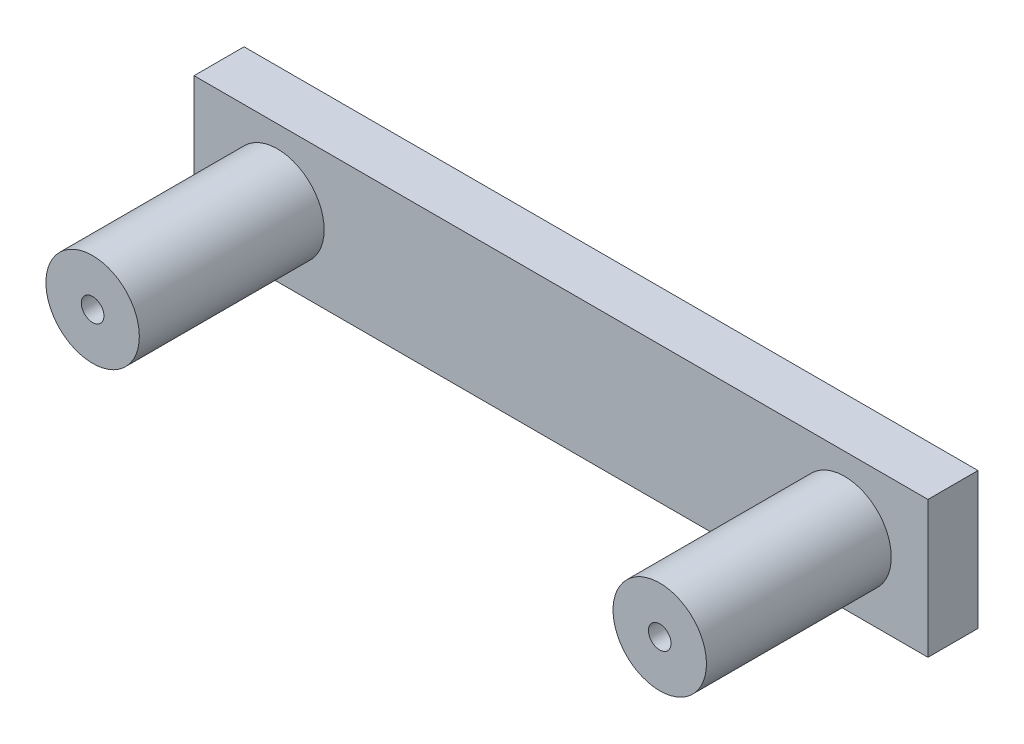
ISO-10303-21;
HEADER;
FILE_DESCRIPTION(('STEP AP214'),'2;1');
FILE_NAME('part.step','',(''),(''),'','','');
FILE_SCHEMA(('AUTOMOTIVE_DESIGN { 1 0 10303 214 1 1 1 1 }'));
ENDSEC;
DATA;
#1=APPLICATION_CONTEXT('core data for automotive mechanical design processes');
#2=APPLICATION_PROTOCOL_DEFINITION('international standard','automotive_design',2000,#1);
#3=PRODUCT_CONTEXT('',#1,'mechanical');
#4=PRODUCT('Part','Part','',(#3));
#5=PRODUCT_RELATED_PRODUCT_CATEGORY('part','',(#4));
#6=PRODUCT_DEFINITION_FORMATION('','',#4);
#7=PRODUCT_DEFINITION_CONTEXT('part definition',#1,'design');
#8=PRODUCT_DEFINITION('design','',#6,#7);
#9=PRODUCT_DEFINITION_SHAPE('','',#8);
#10=(LENGTH_UNIT() NAMED_UNIT(*) SI_UNIT(.MILLI.,.METRE.));
#11=(NAMED_UNIT(*) PLANE_ANGLE_UNIT() SI_UNIT($,.RADIAN.));
#12=(NAMED_UNIT(*) SI_UNIT($,.STERADIAN.) SOLID_ANGLE_UNIT());
#13=UNCERTAINTY_MEASURE_WITH_UNIT(LENGTH_MEASURE(1.E-05),#10,'distance_accuracy_value','');
#14=(GEOMETRIC_REPRESENTATION_CONTEXT(3) GLOBAL_UNCERTAINTY_ASSIGNED_CONTEXT((#13)) GLOBAL_UNIT_ASSIGNED_CONTEXT((#10,
#11,#12)) REPRESENTATION_CONTEXT('',''));
#15=CARTESIAN_POINT('',(0.,0.,0.));
#16=DIRECTION('',(0.,0.,1.));
#17=DIRECTION('',(1.,0.,0.));
#18=AXIS2_PLACEMENT_3D('',#15,#16,#17);
#19=CARTESIAN_POINT('',(-69.85,-13.0175,9.525));
#20=DIRECTION('',(0.,0.,1.));
#21=DIRECTION('',(1.,0.,0.));
#22=AXIS2_PLACEMENT_3D('',#19,#20,#21);
#23=PLANE('',#22);
#24=CARTESIAN_POINT('',(-53.975,0.,9.525));
#25=DIRECTION('',(0.,0.,1.));
#26=DIRECTION('',(1.,0.,0.));
#27=AXIS2_PLACEMENT_3D('',#24,#25,#26);
#28=CIRCLE('',#27,8.88999999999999);
#29=CARTESIAN_POINT('',(-45.085,0.,9.525));
#30=VERTEX_POINT('',#29);
#31=EDGE_CURVE('E110',#30,#30,#28,.T.);
#32=ORIENTED_EDGE('',*,*,#31,.F.);
#33=EDGE_LOOP('',(#32));
#34=FACE_BOUND('',#33,.T.);
#35=DIRECTION('',(0.,-1.,0.));
#36=VECTOR('',#35,1.);
#37=CARTESIAN_POINT('',(-69.85,13.0175,9.525));
#38=LINE('',#37,#36);
#39=CARTESIAN_POINT('',(-69.85,13.0175,9.525));
#40=VERTEX_POINT('',#39);
#41=CARTESIAN_POINT('',(-69.85,-13.0175,9.525));
#42=VERTEX_POINT('',#41);
#43=EDGE_CURVE('E84',#40,#42,#38,.T.);
#44=ORIENTED_EDGE('',*,*,#43,.T.);
#45=DIRECTION('',(1.,0.,0.));
#46=VECTOR('',#45,1.);
#47=CARTESIAN_POINT('',(-69.85,-13.0175,9.525));
#48=LINE('',#47,#46);
#49=CARTESIAN_POINT('',(69.85,-13.0175,9.525));
#50=VERTEX_POINT('',#49);
#51=EDGE_CURVE('E79',#42,#50,#48,.T.);
#52=ORIENTED_EDGE('',*,*,#51,.T.);
#53=DIRECTION('',(0.,1.,0.));
#54=VECTOR('',#53,1.);
#55=CARTESIAN_POINT('',(69.85,13.0175,9.525));
#56=LINE('',#55,#54);
#57=CARTESIAN_POINT('',(69.85,13.0175,9.525));
#58=VERTEX_POINT('',#57);
#59=EDGE_CURVE('E82',#50,#58,#56,.T.);
#60=ORIENTED_EDGE('',*,*,#59,.T.);
#61=DIRECTION('',(-1.,0.,0.));
#62=VECTOR('',#61,1.);
#63=CARTESIAN_POINT('',(-69.85,13.0175,9.525));
#64=LINE('',#63,#62);
#65=EDGE_CURVE('E49',#58,#40,#64,.T.);
#66=ORIENTED_EDGE('',*,*,#65,.T.);
#67=EDGE_LOOP('',(#44,#52,#60,#66));
#68=FACE_BOUND('',#67,.T.);
#69=CARTESIAN_POINT('',(53.975,0.,9.525));
#70=DIRECTION('',(0.,0.,1.));
#71=DIRECTION('',(1.,0.,0.));
#72=AXIS2_PLACEMENT_3D('',#69,#70,#71);
#73=CIRCLE('',#72,8.88999999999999);
#74=CARTESIAN_POINT('',(62.865,0.,9.525));
#75=VERTEX_POINT('',#74);
#76=EDGE_CURVE('E116',#75,#75,#73,.T.);
#77=ORIENTED_EDGE('',*,*,#76,.F.);
#78=EDGE_LOOP('',(#77));
#79=FACE_BOUND('',#78,.T.);
#80=ADVANCED_FACE('F32',(#34,#68,#79),#23,.T.);
#81=CARTESIAN_POINT('',(-69.85,13.0175,9.525));
#82=DIRECTION('',(1.,0.,0.));
#83=DIRECTION('',(0.,1.,0.));
#84=AXIS2_PLACEMENT_3D('',#81,#82,#83);
#85=PLANE('',#84);
#86=DIRECTION('',(0.,-1.,0.));
#87=VECTOR('',#86,1.);
#88=CARTESIAN_POINT('',(-69.85,13.0175,0.));
#89=LINE('',#88,#87);
#90=CARTESIAN_POINT('',(-69.85,13.0175,0.));
#91=VERTEX_POINT('',#90);
#92=CARTESIAN_POINT('',(-69.85,-13.0175,0.));
#93=VERTEX_POINT('',#92);
#94=EDGE_CURVE('E96',#91,#93,#89,.T.);
#95=ORIENTED_EDGE('',*,*,#94,.T.);
#96=DIRECTION('',(0.,0.,-1.));
#97=VECTOR('',#96,1.);
#98=CARTESIAN_POINT('',(-69.85,-13.0175,9.525));
#99=LINE('',#98,#97);
#100=EDGE_CURVE('E11',#42,#93,#99,.T.);
#101=ORIENTED_EDGE('',*,*,#100,.F.);
#102=ORIENTED_EDGE('',*,*,#43,.F.);
#103=DIRECTION('',(0.,0.,-1.));
#104=VECTOR('',#103,1.);
#105=CARTESIAN_POINT('',(-69.85,13.0175,9.525));
#106=LINE('',#105,#104);
#107=EDGE_CURVE('E92',#40,#91,#106,.T.);
#108=ORIENTED_EDGE('',*,*,#107,.T.);
#109=EDGE_LOOP('',(#95,#101,#102,#108));
#110=FACE_BOUND('',#109,.T.);
#111=ADVANCED_FACE('F34',(#110),#85,.F.);
#112=CARTESIAN_POINT('',(-69.85,-13.0175,9.525));
#113=DIRECTION('',(0.,1.,0.));
#114=DIRECTION('',(0.,0.,1.));
#115=AXIS2_PLACEMENT_3D('',#112,#113,#114);
#116=PLANE('',#115);
#117=DIRECTION('',(1.,0.,0.));
#118=VECTOR('',#117,1.);
#119=CARTESIAN_POINT('',(-69.85,-13.0175,0.));
#120=LINE('',#119,#118);
#121=CARTESIAN_POINT('',(69.85,-13.0175,0.));
#122=VERTEX_POINT('',#121);
#123=EDGE_CURVE('E88',#93,#122,#120,.T.);
#124=ORIENTED_EDGE('',*,*,#123,.T.);
#125=DIRECTION('',(0.,0.,-1.));
#126=VECTOR('',#125,1.);
#127=CARTESIAN_POINT('',(69.85,-13.0175,9.525));
#128=LINE('',#127,#126);
#129=EDGE_CURVE('E41',#50,#122,#128,.T.);
#130=ORIENTED_EDGE('',*,*,#129,.F.);
#131=ORIENTED_EDGE('',*,*,#51,.F.);
#132=ORIENTED_EDGE('',*,*,#100,.T.);
#133=EDGE_LOOP('',(#124,#130,#131,#132));
#134=FACE_BOUND('',#133,.T.);
#135=ADVANCED_FACE('F87',(#134),#116,.F.);
#136=CARTESIAN_POINT('',(69.85,13.0175,9.525));
#137=DIRECTION('',(-1.,0.,0.));
#138=DIRECTION('',(0.,-1.,0.));
#139=AXIS2_PLACEMENT_3D('',#136,#137,#138);
#140=PLANE('',#139);
#141=DIRECTION('',(0.,1.,0.));
#142=VECTOR('',#141,1.);
#143=CARTESIAN_POINT('',(69.85,13.0175,0.));
#144=LINE('',#143,#142);
#145=CARTESIAN_POINT('',(69.85,13.0175,0.));
#146=VERTEX_POINT('',#145);
#147=EDGE_CURVE('E66',#122,#146,#144,.T.);
#148=ORIENTED_EDGE('',*,*,#147,.T.);
#149=DIRECTION('',(0.,0.,-1.));
#150=VECTOR('',#149,1.);
#151=CARTESIAN_POINT('',(69.85,13.0175,9.525));
#152=LINE('',#151,#150);
#153=EDGE_CURVE('E89',#58,#146,#152,.T.);
#154=ORIENTED_EDGE('',*,*,#153,.F.);
#155=ORIENTED_EDGE('',*,*,#59,.F.);
#156=ORIENTED_EDGE('',*,*,#129,.T.);
#157=EDGE_LOOP('',(#148,#154,#155,#156));
#158=FACE_BOUND('',#157,.T.);
#159=ADVANCED_FACE('F90',(#158),#140,.F.);
#160=CARTESIAN_POINT('',(-69.85,13.0175,9.525));
#161=DIRECTION('',(0.,-1.,0.));
#162=DIRECTION('',(0.,0.,-1.));
#163=AXIS2_PLACEMENT_3D('',#160,#161,#162);
#164=PLANE('',#163);
#165=DIRECTION('',(-1.,0.,0.));
#166=VECTOR('',#165,1.);
#167=CARTESIAN_POINT('',(-69.85,13.0175,0.));
#168=LINE('',#167,#166);
#169=EDGE_CURVE('E72',#146,#91,#168,.T.);
#170=ORIENTED_EDGE('',*,*,#169,.T.);
#171=ORIENTED_EDGE('',*,*,#107,.F.);
#172=ORIENTED_EDGE('',*,*,#65,.F.);
#173=ORIENTED_EDGE('',*,*,#153,.T.);
#174=EDGE_LOOP('',(#170,#171,#172,#173));
#175=FACE_BOUND('',#174,.T.);
#176=ADVANCED_FACE('F104',(#175),#164,.F.);
#177=CARTESIAN_POINT('',(-69.85,-13.0175,0.));
#178=DIRECTION('',(0.,0.,1.));
#179=DIRECTION('',(1.,0.,0.));
#180=AXIS2_PLACEMENT_3D('',#177,#178,#179);
#181=PLANE('',#180);
#182=CARTESIAN_POINT('',(-53.975,0.,0.));
#183=DIRECTION('',(0.,0.,-1.));
#184=DIRECTION('',(-1.,0.,0.));
#185=AXIS2_PLACEMENT_3D('',#182,#183,#184);
#186=CIRCLE('',#185,3.96874999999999);
#187=CARTESIAN_POINT('',(-57.94375,0.,0.));
#188=VERTEX_POINT('',#187);
#189=EDGE_CURVE('E142',#188,#188,#186,.T.);
#190=ORIENTED_EDGE('',*,*,#189,.F.);
#191=EDGE_LOOP('',(#190));
#192=FACE_BOUND('',#191,.T.);
#193=CARTESIAN_POINT('',(53.975,0.,0.));
#194=DIRECTION('',(0.,0.,-1.));
#195=DIRECTION('',(-1.,0.,0.));
#196=AXIS2_PLACEMENT_3D('',#193,#194,#195);
#197=CIRCLE('',#196,3.96874999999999);
#198=CARTESIAN_POINT('',(50.00625,0.,0.));
#199=VERTEX_POINT('',#198);
#200=EDGE_CURVE('E130',#199,#199,#197,.T.);
#201=ORIENTED_EDGE('',*,*,#200,.F.);
#202=EDGE_LOOP('',(#201));
#203=FACE_BOUND('',#202,.T.);
#204=ORIENTED_EDGE('',*,*,#94,.F.);
#205=ORIENTED_EDGE('',*,*,#169,.F.);
#206=ORIENTED_EDGE('',*,*,#147,.F.);
#207=ORIENTED_EDGE('',*,*,#123,.F.);
#208=EDGE_LOOP('',(#204,#205,#206,#207));
#209=FACE_BOUND('',#208,.T.);
#210=ADVANCED_FACE('F107',(#192,#203,#209),#181,.F.);
#211=CARTESIAN_POINT('',(-53.975,0.,44.704));
#212=DIRECTION('',(0.,0.,-1.));
#213=DIRECTION('',(-1.,0.,0.));
#214=AXIS2_PLACEMENT_3D('',#211,#212,#213);
#215=CYLINDRICAL_SURFACE('',#214,8.88999999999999);
#216=CARTESIAN_POINT('',(-53.975,0.,44.704));
#217=DIRECTION('',(0.,0.,1.));
#218=DIRECTION('',(1.,0.,0.));
#219=AXIS2_PLACEMENT_3D('',#216,#217,#218);
#220=CIRCLE('',#219,8.88999999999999);
#221=CARTESIAN_POINT('',(-45.085,0.,44.704));
#222=VERTEX_POINT('',#221);
#223=EDGE_CURVE('E99',#222,#222,#220,.T.);
#224=ORIENTED_EDGE('',*,*,#223,.F.);
#225=EDGE_LOOP('',(#224));
#226=FACE_BOUND('',#225,.T.);
#227=ORIENTED_EDGE('',*,*,#31,.T.);
#228=EDGE_LOOP('',(#227));
#229=FACE_BOUND('',#228,.T.);
#230=ADVANCED_FACE('F150',(#226,#229),#215,.T.);
#231=CARTESIAN_POINT('',(-53.975,0.,44.704));
#232=DIRECTION('',(0.,0.,1.));
#233=DIRECTION('',(1.,0.,0.));
#234=AXIS2_PLACEMENT_3D('',#231,#232,#233);
#235=PLANE('',#234);
#236=CARTESIAN_POINT('',(-53.975,0.,44.704));
#237=DIRECTION('',(0.,0.,-1.));
#238=DIRECTION('',(-1.,0.,0.));
#239=AXIS2_PLACEMENT_3D('',#236,#237,#238);
#240=CIRCLE('',#239,2.15264999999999);
#241=CARTESIAN_POINT('',(-56.12765,0.,44.704));
#242=VERTEX_POINT('',#241);
#243=EDGE_CURVE('E133',#242,#242,#240,.T.);
#244=ORIENTED_EDGE('',*,*,#243,.T.);
#245=EDGE_LOOP('',(#244));
#246=FACE_BOUND('',#245,.T.);
#247=ORIENTED_EDGE('',*,*,#223,.T.);
#248=EDGE_LOOP('',(#247));
#249=FACE_BOUND('',#248,.T.);
#250=ADVANCED_FACE('F209',(#246,#249),#235,.T.);
#251=CARTESIAN_POINT('',(53.975,0.,44.704));
#252=DIRECTION('',(0.,0.,-1.));
#253=DIRECTION('',(-1.,0.,0.));
#254=AXIS2_PLACEMENT_3D('',#251,#252,#253);
#255=CYLINDRICAL_SURFACE('',#254,8.88999999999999);
#256=CARTESIAN_POINT('',(53.975,0.,44.704));
#257=DIRECTION('',(0.,0.,1.));
#258=DIRECTION('',(1.,0.,0.));
#259=AXIS2_PLACEMENT_3D('',#256,#257,#258);
#260=CIRCLE('',#259,8.88999999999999);
#261=CARTESIAN_POINT('',(62.865,0.,44.704));
#262=VERTEX_POINT('',#261);
#263=EDGE_CURVE('E113',#262,#262,#260,.T.);
#264=ORIENTED_EDGE('',*,*,#263,.F.);
#265=EDGE_LOOP('',(#264));
#266=FACE_BOUND('',#265,.T.);
#267=ORIENTED_EDGE('',*,*,#76,.T.);
#268=EDGE_LOOP('',(#267));
#269=FACE_BOUND('',#268,.T.);
#270=ADVANCED_FACE('F215',(#266,#269),#255,.T.);
#271=CARTESIAN_POINT('',(53.975,0.,44.704));
#272=DIRECTION('',(0.,0.,1.));
#273=DIRECTION('',(1.,0.,0.));
#274=AXIS2_PLACEMENT_3D('',#271,#272,#273);
#275=PLANE('',#274);
#276=CARTESIAN_POINT('',(53.975,0.,44.704));
#277=DIRECTION('',(0.,0.,-1.));
#278=DIRECTION('',(-1.,0.,0.));
#279=AXIS2_PLACEMENT_3D('',#276,#277,#278);
#280=CIRCLE('',#279,2.15264999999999);
#281=CARTESIAN_POINT('',(51.82235,0.,44.704));
#282=VERTEX_POINT('',#281);
#283=EDGE_CURVE('E119',#282,#282,#280,.T.);
#284=ORIENTED_EDGE('',*,*,#283,.T.);
#285=EDGE_LOOP('',(#284));
#286=FACE_BOUND('',#285,.T.);
#287=ORIENTED_EDGE('',*,*,#263,.T.);
#288=EDGE_LOOP('',(#287));
#289=FACE_BOUND('',#288,.T.);
#290=ADVANCED_FACE('F222',(#286,#289),#275,.T.);
#291=CARTESIAN_POINT('',(53.975,0.,0.));
#292=DIRECTION('',(0.,0.,-1.));
#293=DIRECTION('',(-1.,0.,0.));
#294=AXIS2_PLACEMENT_3D('',#291,#292,#293);
#295=CYLINDRICAL_SURFACE('',#294,2.15265);
#296=ORIENTED_EDGE('',*,*,#283,.F.);
#297=EDGE_LOOP('',(#296));
#298=FACE_BOUND('',#297,.T.);
#299=CARTESIAN_POINT('',(53.975,0.,6.35));
#300=DIRECTION('',(0.,0.,-1.));
#301=DIRECTION('',(-1.,0.,0.));
#302=AXIS2_PLACEMENT_3D('',#299,#300,#301);
#303=CIRCLE('',#302,2.15265);
#304=CARTESIAN_POINT('',(51.82235,0.,6.35));
#305=VERTEX_POINT('',#304);
#306=EDGE_CURVE('E124',#305,#305,#303,.T.);
#307=ORIENTED_EDGE('',*,*,#306,.T.);
#308=EDGE_LOOP('',(#307));
#309=FACE_BOUND('',#308,.T.);
#310=ADVANCED_FACE('F167',(#298,#309),#295,.F.);
#311=CARTESIAN_POINT('',(56.12765,0.,6.35));
#312=DIRECTION('',(0.,0.,1.));
#313=DIRECTION('',(1.,0.,0.));
#314=AXIS2_PLACEMENT_3D('',#311,#312,#313);
#315=PLANE('',#314);
#316=ORIENTED_EDGE('',*,*,#306,.F.);
#317=EDGE_LOOP('',(#316));
#318=FACE_BOUND('',#317,.T.);
#319=CARTESIAN_POINT('',(53.975,0.,6.35));
#320=DIRECTION('',(0.,0.,-1.));
#321=DIRECTION('',(-1.,0.,0.));
#322=AXIS2_PLACEMENT_3D('',#319,#320,#321);
#323=CIRCLE('',#322,3.96874999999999);
#324=CARTESIAN_POINT('',(50.00625,0.,6.35));
#325=VERTEX_POINT('',#324);
#326=EDGE_CURVE('E127',#325,#325,#323,.T.);
#327=ORIENTED_EDGE('',*,*,#326,.T.);
#328=EDGE_LOOP('',(#327));
#329=FACE_BOUND('',#328,.T.);
#330=ADVANCED_FACE('F157',(#318,#329),#315,.F.);
#331=CARTESIAN_POINT('',(53.975,0.,0.));
#332=DIRECTION('',(0.,0.,-1.));
#333=DIRECTION('',(-1.,0.,0.));
#334=AXIS2_PLACEMENT_3D('',#331,#332,#333);
#335=CYLINDRICAL_SURFACE('',#334,3.96874999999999);
#336=ORIENTED_EDGE('',*,*,#326,.F.);
#337=EDGE_LOOP('',(#336));
#338=FACE_BOUND('',#337,.T.);
#339=ORIENTED_EDGE('',*,*,#200,.T.);
#340=EDGE_LOOP('',(#339));
#341=FACE_BOUND('',#340,.T.);
#342=ADVANCED_FACE('F154',(#338,#341),#335,.F.);
#343=CARTESIAN_POINT('',(-53.975,0.,0.));
#344=DIRECTION('',(0.,0.,-1.));
#345=DIRECTION('',(-1.,0.,0.));
#346=AXIS2_PLACEMENT_3D('',#343,#344,#345);
#347=CYLINDRICAL_SURFACE('',#346,2.15265);
#348=ORIENTED_EDGE('',*,*,#243,.F.);
#349=EDGE_LOOP('',(#348));
#350=FACE_BOUND('',#349,.T.);
#351=CARTESIAN_POINT('',(-53.975,0.,6.35));
#352=DIRECTION('',(0.,0.,-1.));
#353=DIRECTION('',(-1.,0.,0.));
#354=AXIS2_PLACEMENT_3D('',#351,#352,#353);
#355=CIRCLE('',#354,2.15265);
#356=CARTESIAN_POINT('',(-56.12765,0.,6.35));
#357=VERTEX_POINT('',#356);
#358=EDGE_CURVE('E136',#357,#357,#355,.T.);
#359=ORIENTED_EDGE('',*,*,#358,.T.);
#360=EDGE_LOOP('',(#359));
#361=FACE_BOUND('',#360,.T.);
#362=ADVANCED_FACE('F156',(#350,#361),#347,.F.);
#363=CARTESIAN_POINT('',(-51.82235,0.,6.35));
#364=DIRECTION('',(0.,0.,1.));
#365=DIRECTION('',(1.,0.,0.));
#366=AXIS2_PLACEMENT_3D('',#363,#364,#365);
#367=PLANE('',#366);
#368=ORIENTED_EDGE('',*,*,#358,.F.);
#369=EDGE_LOOP('',(#368));
#370=FACE_BOUND('',#369,.T.);
#371=CARTESIAN_POINT('',(-53.975,0.,6.35));
#372=DIRECTION('',(0.,0.,-1.));
#373=DIRECTION('',(-1.,0.,0.));
#374=AXIS2_PLACEMENT_3D('',#371,#372,#373);
#375=CIRCLE('',#374,3.96874999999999);
#376=CARTESIAN_POINT('',(-57.94375,0.,6.35));
#377=VERTEX_POINT('',#376);
#378=EDGE_CURVE('E139',#377,#377,#375,.T.);
#379=ORIENTED_EDGE('',*,*,#378,.T.);
#380=EDGE_LOOP('',(#379));
#381=FACE_BOUND('',#380,.T.);
#382=ADVANCED_FACE('F164',(#370,#381),#367,.F.);
#383=CARTESIAN_POINT('',(-53.975,0.,0.));
#384=DIRECTION('',(0.,0.,-1.));
#385=DIRECTION('',(-1.,0.,0.));
#386=AXIS2_PLACEMENT_3D('',#383,#384,#385);
#387=CYLINDRICAL_SURFACE('',#386,3.96874999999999);
#388=ORIENTED_EDGE('',*,*,#378,.F.);
#389=EDGE_LOOP('',(#388));
#390=FACE_BOUND('',#389,.T.);
#391=ORIENTED_EDGE('',*,*,#189,.T.);
#392=EDGE_LOOP('',(#391));
#393=FACE_BOUND('',#392,.T.);
#394=ADVANCED_FACE('F146',(#390,#393),#387,.F.);
#395=CLOSED_SHELL('',(#80,#111,#135,#159,#176,#210,#230,#250,#270,#290,#310,#330,#342,#362,#382,#394));
#396=MANIFOLD_SOLID_BREP('B2',#395);
#397=ADVANCED_BREP_SHAPE_REPRESENTATION('',(#18,#396),#14);
#398=SHAPE_DEFINITION_REPRESENTATION(#9,#397);
ENDSEC;
END-ISO-10303-21;
